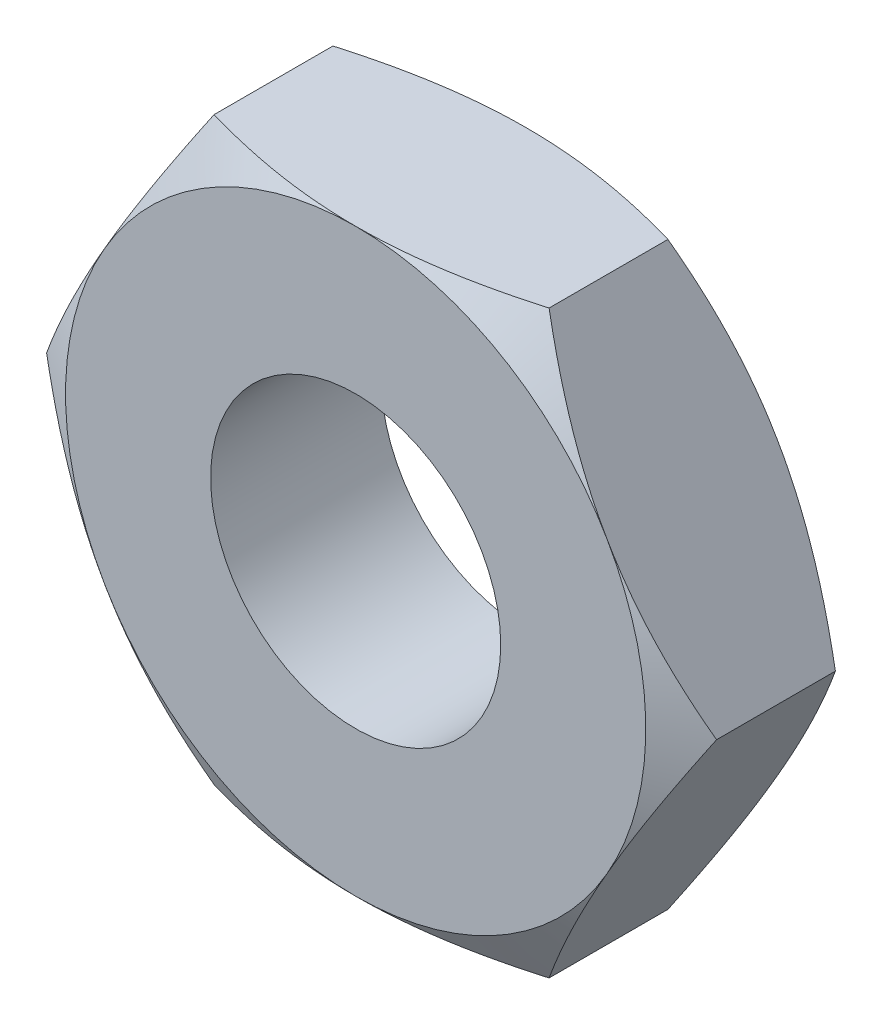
ISO-10303-21;
HEADER;
FILE_DESCRIPTION(('STEP AP214'),'2;1');
FILE_NAME('part.step','',(''),(''),'','','');
FILE_SCHEMA(('AUTOMOTIVE_DESIGN { 1 0 10303 214 1 1 1 1 }'));
ENDSEC;
DATA;
#1=APPLICATION_CONTEXT('core data for automotive mechanical design processes');
#2=APPLICATION_PROTOCOL_DEFINITION('international standard','automotive_design',2000,#1);
#3=PRODUCT_CONTEXT('',#1,'mechanical');
#4=PRODUCT('Part','Part','',(#3));
#5=PRODUCT_RELATED_PRODUCT_CATEGORY('part','',(#4));
#6=PRODUCT_DEFINITION_FORMATION('','',#4);
#7=PRODUCT_DEFINITION_CONTEXT('part definition',#1,'design');
#8=PRODUCT_DEFINITION('design','',#6,#7);
#9=PRODUCT_DEFINITION_SHAPE('','',#8);
#10=(LENGTH_UNIT() NAMED_UNIT(*) SI_UNIT(.MILLI.,.METRE.));
#11=(NAMED_UNIT(*) PLANE_ANGLE_UNIT() SI_UNIT($,.RADIAN.));
#12=(NAMED_UNIT(*) SI_UNIT($,.STERADIAN.) SOLID_ANGLE_UNIT());
#13=UNCERTAINTY_MEASURE_WITH_UNIT(LENGTH_MEASURE(1.E-05),#10,'distance_accuracy_value','');
#14=(GEOMETRIC_REPRESENTATION_CONTEXT(3) GLOBAL_UNCERTAINTY_ASSIGNED_CONTEXT((#13)) GLOBAL_UNIT_ASSIGNED_CONTEXT((#10,
#11,#12)) REPRESENTATION_CONTEXT('',''));
#15=CARTESIAN_POINT('',(0.,0.,0.));
#16=DIRECTION('',(0.,0.,1.));
#17=DIRECTION('',(1.,0.,0.));
#18=AXIS2_PLACEMENT_3D('',#15,#16,#17);
#19=CARTESIAN_POINT('',(-4.90747728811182,-8.5,5.));
#20=DIRECTION('',(0.,1.,0.));
#21=DIRECTION('',(0.,0.,1.));
#22=AXIS2_PLACEMENT_3D('',#19,#20,#21);
#23=PLANE('',#22);
#24=DIRECTION('',(0.,0.,-1.));
#25=VECTOR('',#24,1.);
#26=CARTESIAN_POINT('',(-4.90747728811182,-8.5,5.));
#27=LINE('',#26,#25);
#28=CARTESIAN_POINT('',(-4.90747728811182,-8.5,4.24081062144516));
#29=VERTEX_POINT('',#28);
#30=CARTESIAN_POINT('',(-4.90747728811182,-8.5,0.759189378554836));
#31=VERTEX_POINT('',#30);
#32=EDGE_CURVE('E257',#29,#31,#27,.T.);
#33=ORIENTED_EDGE('',*,*,#32,.T.);
#34=CARTESIAN_POINT('',(-13.0153529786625,-8.5,4.06747699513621));
#35=CARTESIAN_POINT('',(-12.6421549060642,-8.5,3.88712707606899));
#36=CARTESIAN_POINT('',(-12.2680744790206,-8.5,3.70856998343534));
#37=CARTESIAN_POINT('',(-11.5176718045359,-8.5,3.35606593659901));
#38=CARTESIAN_POINT('',(-11.1413491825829,-8.5,3.18211978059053));
#39=CARTESIAN_POINT('',(-10.3839521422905,-8.5,2.83894573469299));
#40=CARTESIAN_POINT('',(-10.0028628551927,-8.5,2.66975054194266));
#41=CARTESIAN_POINT('',(-9.23755213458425,-8.5,2.33862749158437));
#42=CARTESIAN_POINT('',(-8.85333086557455,-8.5,2.17669925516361));
#43=CARTESIAN_POINT('',(-8.07637493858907,-8.5,1.86012014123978));
#44=CARTESIAN_POINT('',(-7.68359367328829,-8.5,1.70558301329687));
#45=CARTESIAN_POINT('',(-6.89339929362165,-8.5,1.40861195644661));
#46=CARTESIAN_POINT('',(-6.4959856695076,-8.5,1.26617937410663));
#47=CARTESIAN_POINT('',(-5.69670564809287,-8.5,0.997245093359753));
#48=CARTESIAN_POINT('',(-5.29485077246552,-8.5,0.870709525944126));
#49=CARTESIAN_POINT('',(-4.48544256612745,-8.5,0.637676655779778));
#50=CARTESIAN_POINT('',(-4.07789108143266,-8.5,0.531173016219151));
#51=CARTESIAN_POINT('',(-3.25674318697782,-8.5,0.343382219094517));
#52=CARTESIAN_POINT('',(-2.84314519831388,-8.5,0.262101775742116));
#53=CARTESIAN_POINT('',(-2.21910871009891,-8.5,0.163168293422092));
#54=CARTESIAN_POINT('',(-2.01046436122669,-8.5,0.134019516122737));
#55=CARTESIAN_POINT('',(-1.59219744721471,-8.5,0.0839578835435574));
#56=CARTESIAN_POINT('',(-1.38257498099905,-8.5,0.0630442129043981));
#57=CARTESIAN_POINT('',(-0.963964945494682,-8.5,0.0300156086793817));
#58=CARTESIAN_POINT('',(-0.754981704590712,-8.5,0.0178460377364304));
#59=CARTESIAN_POINT('',(-0.336687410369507,-8.5,0.00236997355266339));
#60=CARTESIAN_POINT('',(-0.12737636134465,-8.5,-0.000936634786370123));
#61=CARTESIAN_POINT('',(0.291137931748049,-8.5,0.00139201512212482));
#62=CARTESIAN_POINT('',(0.500341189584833,-8.5,0.00702476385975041));
#63=CARTESIAN_POINT('',(0.918327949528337,-8.5,0.0270920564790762));
#64=CARTESIAN_POINT('',(1.12711143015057,-8.5,0.0415270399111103));
#65=CARTESIAN_POINT('',(1.63313830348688,-8.5,0.0868790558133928));
#66=CARTESIAN_POINT('',(1.92999290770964,-8.5,0.122206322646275));
#67=CARTESIAN_POINT('',(2.52142734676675,-8.5,0.208694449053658));
#68=CARTESIAN_POINT('',(2.81600653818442,-8.5,0.259859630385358));
#69=CARTESIAN_POINT('',(3.40264712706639,-8.5,0.3762089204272));
#70=CARTESIAN_POINT('',(3.69470587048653,-8.5,0.441406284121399));
#71=CARTESIAN_POINT('',(4.27581848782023,-8.5,0.583830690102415));
#72=CARTESIAN_POINT('',(4.56487264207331,-8.5,0.661056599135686));
#73=CARTESIAN_POINT('',(5.14709542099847,-8.5,0.827709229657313));
#74=CARTESIAN_POINT('',(5.44019122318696,-8.5,0.917388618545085));
#75=CARTESIAN_POINT('',(6.02328479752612,-8.5,1.10560823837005));
#76=CARTESIAN_POINT('',(6.31328455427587,-8.5,1.20414235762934));
#77=CARTESIAN_POINT('',(6.88902237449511,-8.5,1.40803611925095));
#78=CARTESIAN_POINT('',(7.17477523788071,-8.5,1.51335422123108));
#79=CARTESIAN_POINT('',(7.74406391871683,-8.5,1.73017199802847));
#80=CARTESIAN_POINT('',(8.02759878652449,-8.5,1.84167417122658));
#81=CARTESIAN_POINT('',(8.31010360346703,-8.5,1.95565663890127));
#82=B_SPLINE_CURVE_WITH_KNOTS('',3,(#34,#35,#36,#37,#38,#39,#40,#41,#42,#43,#44,#45,#46,#47,#48,
#49,#50,#51,#52,#53,#54,#55,#56,#57,#58,#59,#60,#61,#62,#63,#64,#65,#66,#67,#68,#69,#70,#71,#72,
#73,#74,#75,#76,#77,#78,#79,#80,#81),.UNSPECIFIED.,.F.,.F.,(4,2,2,2,2,2,2,2,2,2,2,2,2,2,2,2,2,2,
2,2,2,2,2,4),(0.,1.24349005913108,2.4871939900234,3.7380151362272,4.98877100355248,
6.25488227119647,7.52113420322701,8.78464087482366,10.0477471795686,11.3111894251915,
11.9430642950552,12.5748765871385,13.2027058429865,13.8305269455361,14.4581718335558,
15.0858480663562,15.9821964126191,16.8787895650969,17.7762333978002,18.6735927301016,
19.5929482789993,20.5116740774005,21.4252286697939,22.3391550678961),.UNSPECIFIED.);
#83=CARTESIAN_POINT('',(0.,-8.5,0.));
#84=VERTEX_POINT('',#83);
#85=EDGE_CURVE('E60',#31,#84,#82,.T.);
#86=ORIENTED_EDGE('',*,*,#85,.T.);
#87=CARTESIAN_POINT('',(4.90747728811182,-8.5,0.759189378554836));
#88=VERTEX_POINT('',#87);
#89=EDGE_CURVE('E214',#84,#88,#82,.T.);
#90=ORIENTED_EDGE('',*,*,#89,.T.);
#91=DIRECTION('',(0.,0.,-1.));
#92=VECTOR('',#91,1.);
#93=CARTESIAN_POINT('',(4.90747728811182,-8.5,5.));
#94=LINE('',#93,#92);
#95=CARTESIAN_POINT('',(4.90747728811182,-8.5,4.24081062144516));
#96=VERTEX_POINT('',#95);
#97=EDGE_CURVE('E274',#96,#88,#94,.T.);
#98=ORIENTED_EDGE('',*,*,#97,.F.);
#99=CARTESIAN_POINT('',(-13.0153529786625,-8.5,0.932523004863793));
#100=CARTESIAN_POINT('',(-12.6421549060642,-8.5,1.11287292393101));
#101=CARTESIAN_POINT('',(-12.2680744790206,-8.5,1.29143001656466));
#102=CARTESIAN_POINT('',(-11.5176718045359,-8.5,1.64393406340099));
#103=CARTESIAN_POINT('',(-11.1413491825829,-8.5,1.81788021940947));
#104=CARTESIAN_POINT('',(-10.3839521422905,-8.5,2.16105426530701));
#105=CARTESIAN_POINT('',(-10.0028628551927,-8.5,2.33024945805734));
#106=CARTESIAN_POINT('',(-9.23755213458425,-8.5,2.66137250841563));
#107=CARTESIAN_POINT('',(-8.85333086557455,-8.5,2.82330074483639));
#108=CARTESIAN_POINT('',(-8.07637493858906,-8.5,3.13987985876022));
#109=CARTESIAN_POINT('',(-7.68359367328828,-8.5,3.29441698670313));
#110=CARTESIAN_POINT('',(-6.89339929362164,-8.5,3.59138804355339));
#111=CARTESIAN_POINT('',(-6.49598566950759,-8.5,3.73382062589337));
#112=CARTESIAN_POINT('',(-5.69670564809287,-8.5,4.00275490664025));
#113=CARTESIAN_POINT('',(-5.29485077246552,-8.5,4.12929047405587));
#114=CARTESIAN_POINT('',(-4.48544256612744,-8.5,4.36232334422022));
#115=CARTESIAN_POINT('',(-4.07789108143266,-8.5,4.46882698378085));
#116=CARTESIAN_POINT('',(-3.25674318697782,-8.5,4.65661778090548));
#117=CARTESIAN_POINT('',(-2.84314519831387,-8.5,4.73789822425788));
#118=CARTESIAN_POINT('',(-2.2191087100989,-8.5,4.83683170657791));
#119=CARTESIAN_POINT('',(-2.01046436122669,-8.5,4.86598048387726));
#120=CARTESIAN_POINT('',(-1.59219744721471,-8.5,4.91604211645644));
#121=CARTESIAN_POINT('',(-1.38257498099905,-8.5,4.9369557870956));
#122=CARTESIAN_POINT('',(-0.963964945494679,-8.5,4.96998439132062));
#123=CARTESIAN_POINT('',(-0.75498170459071,-8.5,4.98215396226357));
#124=CARTESIAN_POINT('',(-0.336687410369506,-8.5,4.99763002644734));
#125=CARTESIAN_POINT('',(-0.127376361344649,-8.5,5.00093663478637));
#126=CARTESIAN_POINT('',(0.29113793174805,-8.5,4.99860798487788));
#127=CARTESIAN_POINT('',(0.500341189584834,-8.5,4.99297523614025));
#128=CARTESIAN_POINT('',(0.918327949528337,-8.5,4.97290794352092));
#129=CARTESIAN_POINT('',(1.12711143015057,-8.5,4.95847296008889));
#130=CARTESIAN_POINT('',(1.63313830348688,-8.5,4.91312094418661));
#131=CARTESIAN_POINT('',(1.92999290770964,-8.5,4.87779367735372));
#132=CARTESIAN_POINT('',(2.52142734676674,-8.5,4.79130555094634));
#133=CARTESIAN_POINT('',(2.81600653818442,-8.5,4.74014036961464));
#134=CARTESIAN_POINT('',(3.40264712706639,-8.5,4.6237910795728));
#135=CARTESIAN_POINT('',(3.69470587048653,-8.5,4.5585937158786));
#136=CARTESIAN_POINT('',(4.27581848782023,-8.5,4.41616930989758));
#137=CARTESIAN_POINT('',(4.56487264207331,-8.5,4.33894340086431));
#138=CARTESIAN_POINT('',(5.14709542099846,-8.5,4.17229077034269));
#139=CARTESIAN_POINT('',(5.44019122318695,-8.5,4.08261138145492));
#140=CARTESIAN_POINT('',(6.02328479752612,-8.5,3.89439176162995));
#141=CARTESIAN_POINT('',(6.31328455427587,-8.5,3.79585764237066));
#142=CARTESIAN_POINT('',(6.88902237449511,-8.5,3.59196388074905));
#143=CARTESIAN_POINT('',(7.17477523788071,-8.5,3.48664577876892));
#144=CARTESIAN_POINT('',(7.74406391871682,-8.5,3.26982800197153));
#145=CARTESIAN_POINT('',(8.02759878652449,-8.5,3.15832582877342));
#146=CARTESIAN_POINT('',(8.31010360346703,-8.5,3.04434336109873));
#147=B_SPLINE_CURVE_WITH_KNOTS('',3,(#99,#100,#101,#102,#103,#104,#105,#106,#107,#108,#109,#110,
#111,#112,#113,#114,#115,#116,#117,#118,#119,#120,#121,#122,#123,#124,#125,#126,#127,#128,#129,
#130,#131,#132,#133,#134,#135,#136,#137,#138,#139,#140,#141,#142,#143,#144,#145,#146),
.UNSPECIFIED.,.F.,.F.,(4,2,2,2,2,2,2,2,2,2,2,2,2,2,2,2,2,2,2,2,2,2,2,4),(0.,1.24349005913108,
2.4871939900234,3.7380151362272,4.98877100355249,6.25488227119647,7.52113420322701,
8.78464087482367,10.0477471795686,11.3111894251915,11.9430642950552,12.5748765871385,
13.2027058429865,13.8305269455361,14.4581718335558,15.0858480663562,15.9821964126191,
16.8787895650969,17.7762333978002,18.6735927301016,19.5929482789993,20.5116740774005,
21.4252286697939,22.3391550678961),.UNSPECIFIED.);
#148=CARTESIAN_POINT('',(0.,-8.5,5.));
#149=VERTEX_POINT('',#148);
#150=EDGE_CURVE('E326',#96,#149,#147,.F.);
#151=ORIENTED_EDGE('',*,*,#150,.T.);
#152=EDGE_CURVE('E320',#149,#29,#147,.F.);
#153=ORIENTED_EDGE('',*,*,#152,.T.);
#154=EDGE_LOOP('',(#33,#86,#90,#98,#151,#153));
#155=FACE_BOUND('',#154,.T.);
#156=ADVANCED_FACE('F37',(#155),#23,.F.);
#157=CARTESIAN_POINT('',(4.90747728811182,-8.5,5.));
#158=DIRECTION('',(-0.866025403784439,0.5,0.));
#159=DIRECTION('',(-0.5,-0.866025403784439,0.));
#160=AXIS2_PLACEMENT_3D('',#157,#158,#159);
#161=PLANE('',#160);
#162=ORIENTED_EDGE('',*,*,#97,.T.);
#163=CARTESIAN_POINT('',(4.90736181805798,-8.5002,0.75925604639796));
#164=CARTESIAN_POINT('',(5.01523349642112,-8.31336077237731,0.696986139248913));
#165=CARTESIAN_POINT('',(5.1235073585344,-8.1258249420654,0.637542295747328));
#166=CARTESIAN_POINT('',(5.34093440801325,-7.74923024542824,0.525085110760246));
#167=CARTESIAN_POINT('',(5.45008795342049,-7.56017075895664,0.472074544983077));
#168=CARTESIAN_POINT('',(5.77929626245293,-6.98996524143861,0.32373338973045));
#169=CARTESIAN_POINT('',(6.00065055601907,-6.60656835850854,0.23935892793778));
#170=CARTESIAN_POINT('',(6.33190297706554,-6.03282233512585,0.14042001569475));
#171=CARTESIAN_POINT('',(6.44081150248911,-5.84418723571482,0.112235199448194));
#172=CARTESIAN_POINT('',(6.65912106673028,-5.4660639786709,0.064974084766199));
#173=CARTESIAN_POINT('',(6.76852206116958,-5.27657589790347,0.0458969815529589));
#174=CARTESIAN_POINT('',(6.98751241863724,-4.89727347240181,0.0173347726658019));
#175=CARTESIAN_POINT('',(7.09710142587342,-4.70745974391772,0.00783878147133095));
#176=CARTESIAN_POINT('',(7.31638067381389,-4.32765694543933,-0.00135762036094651));
#177=CARTESIAN_POINT('',(7.42607091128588,-4.13766788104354,-0.00105833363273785));
#178=CARTESIAN_POINT('',(7.63114046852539,-3.78247698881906,0.00865447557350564));
#179=CARTESIAN_POINT('',(7.72653426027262,-3.61725009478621,0.0168831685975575));
#180=CARTESIAN_POINT('',(7.9170984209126,-3.28718328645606,0.0405892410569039));
#181=CARTESIAN_POINT('',(8.01226877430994,-3.12234339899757,0.0560671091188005));
#182=CARTESIAN_POINT('',(8.29741139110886,-2.6284618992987,0.113008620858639));
#183=CARTESIAN_POINT('',(8.48687892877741,-2.3002944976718,0.164973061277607));
#184=CARTESIAN_POINT('',(8.86782383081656,-1.64047857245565,0.29488494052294));
#185=CARTESIAN_POINT('',(9.05925257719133,-1.30891425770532,0.373383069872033));
#186=CARTESIAN_POINT('',(9.43925537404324,-0.650730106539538,0.551541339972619));
#187=CARTESIAN_POINT('',(9.62783429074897,-0.324101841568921,0.651159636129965));
#188=CARTESIAN_POINT('',(9.81507004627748,0.000199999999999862,0.75925604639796));
#189=B_SPLINE_CURVE_WITH_KNOTS('',3,(#163,#164,#165,#166,#167,#168,#169,#170,#171,#172,#173,
#174,#175,#176,#177,#178,#179,#180,#181,#182,#183,#184,#185,#186,#187,#188),.UNSPECIFIED.,.F.,
.F.,(4,2,2,2,2,2,2,2,2,2,2,2,4),(0.,0.673596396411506,1.34748239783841,2.69805431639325,
3.35679995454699,4.01548737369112,4.67342558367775,5.33134346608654,5.90409556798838,
6.47688628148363,7.62328361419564,8.79510569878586,9.9646274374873),.UNSPECIFIED.);
#190=CARTESIAN_POINT('',(7.36121593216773,-4.25,0.));
#191=VERTEX_POINT('',#190);
#192=EDGE_CURVE('E212',#88,#191,#189,.T.);
#193=ORIENTED_EDGE('',*,*,#192,.T.);
#194=CARTESIAN_POINT('',(9.81495457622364,0.,0.759189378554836));
#195=VERTEX_POINT('',#194);
#196=EDGE_CURVE('E206',#191,#195,#189,.T.);
#197=ORIENTED_EDGE('',*,*,#196,.T.);
#198=DIRECTION('',(0.,0.,-1.));
#199=VECTOR('',#198,1.);
#200=CARTESIAN_POINT('',(9.81495457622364,0.,5.));
#201=LINE('',#200,#199);
#202=CARTESIAN_POINT('',(9.81495457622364,0.,4.24081062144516));
#203=VERTEX_POINT('',#202);
#204=EDGE_CURVE('E270',#203,#195,#201,.T.);
#205=ORIENTED_EDGE('',*,*,#204,.F.);
#206=CARTESIAN_POINT('',(9.81507004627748,0.000199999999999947,4.24074395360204));
#207=CARTESIAN_POINT('',(9.70719836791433,-0.18663922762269,4.30301386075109));
#208=CARTESIAN_POINT('',(9.59892450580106,-0.374175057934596,4.36245770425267));
#209=CARTESIAN_POINT('',(9.3814974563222,-0.750769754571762,4.47491488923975));
#210=CARTESIAN_POINT('',(9.27234391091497,-0.939829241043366,4.52792545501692));
#211=CARTESIAN_POINT('',(8.94313560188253,-1.5100347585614,4.67626661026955));
#212=CARTESIAN_POINT('',(8.72178130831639,-1.89343164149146,4.76064107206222));
#213=CARTESIAN_POINT('',(8.39052888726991,-2.46717766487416,4.85957998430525));
#214=CARTESIAN_POINT('',(8.28162036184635,-2.65581276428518,4.88776480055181));
#215=CARTESIAN_POINT('',(8.06331079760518,-3.03393602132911,4.9350259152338));
#216=CARTESIAN_POINT('',(7.95390980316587,-3.22342410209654,4.95410301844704));
#217=CARTESIAN_POINT('',(7.73491944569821,-3.6027265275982,4.9826652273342));
#218=CARTESIAN_POINT('',(7.62533043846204,-3.79254025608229,4.99216121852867));
#219=CARTESIAN_POINT('',(7.40605119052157,-4.17234305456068,5.00135762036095));
#220=CARTESIAN_POINT('',(7.29636095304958,-4.36233211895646,5.00105833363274));
#221=CARTESIAN_POINT('',(7.09129139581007,-4.71752301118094,4.99134552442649));
#222=CARTESIAN_POINT('',(6.99589760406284,-4.88274990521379,4.98311683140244));
#223=CARTESIAN_POINT('',(6.80533344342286,-5.21281671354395,4.95941075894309));
#224=CARTESIAN_POINT('',(6.71016309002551,-5.37765660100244,4.9439328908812));
#225=CARTESIAN_POINT('',(6.42502047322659,-5.87153810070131,4.88699137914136));
#226=CARTESIAN_POINT('',(6.23555293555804,-6.19970550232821,4.83502693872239));
#227=CARTESIAN_POINT('',(5.8546080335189,-6.85952142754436,4.70511505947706));
#228=CARTESIAN_POINT('',(5.66317928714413,-7.19108574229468,4.62661693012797));
#229=CARTESIAN_POINT('',(5.28317649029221,-7.84926989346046,4.44845866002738));
#230=CARTESIAN_POINT('',(5.09459757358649,-8.17589815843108,4.34884036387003));
#231=CARTESIAN_POINT('',(4.90736181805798,-8.5002,4.24074395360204));
#232=B_SPLINE_CURVE_WITH_KNOTS('',3,(#206,#207,#208,#209,#210,#211,#212,#213,#214,#215,#216,
#217,#218,#219,#220,#221,#222,#223,#224,#225,#226,#227,#228,#229,#230,#231),.UNSPECIFIED.,.F.,
.F.,(4,2,2,2,2,2,2,2,2,2,2,2,4),(0.,0.673596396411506,1.34748239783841,2.69805431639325,
3.35679995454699,4.01548737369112,4.67342558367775,5.33134346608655,5.90409556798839,
6.47688628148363,7.62328361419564,8.79510569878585,9.9646274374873),.UNSPECIFIED.);
#233=CARTESIAN_POINT('',(7.36121593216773,-4.25,5.));
#234=VERTEX_POINT('',#233);
#235=EDGE_CURVE('E235',#203,#234,#232,.T.);
#236=ORIENTED_EDGE('',*,*,#235,.T.);
#237=EDGE_CURVE('E227',#234,#96,#232,.T.);
#238=ORIENTED_EDGE('',*,*,#237,.T.);
#239=EDGE_LOOP('',(#162,#193,#197,#205,#236,#238));
#240=FACE_BOUND('',#239,.T.);
#241=ADVANCED_FACE('F219',(#240),#161,.F.);
#242=CARTESIAN_POINT('',(9.81495457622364,0.,5.));
#243=DIRECTION('',(-0.866025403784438,-0.5,0.));
#244=DIRECTION('',(0.5,-0.866025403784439,0.));
#245=AXIS2_PLACEMENT_3D('',#242,#243,#244);
#246=PLANE('',#245);
#247=ORIENTED_EDGE('',*,*,#204,.T.);
#248=CARTESIAN_POINT('',(9.81507004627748,-0.0002000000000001,0.75925604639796));
#249=CARTESIAN_POINT('',(9.70719836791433,0.18663922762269,0.696986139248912));
#250=CARTESIAN_POINT('',(9.59892450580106,0.374175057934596,0.637542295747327));
#251=CARTESIAN_POINT('',(9.3814974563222,0.750769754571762,0.525085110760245));
#252=CARTESIAN_POINT('',(9.27234391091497,0.939829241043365,0.472074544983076));
#253=CARTESIAN_POINT('',(8.94313560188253,1.5100347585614,0.32373338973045));
#254=CARTESIAN_POINT('',(8.72178130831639,1.89343164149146,0.23935892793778));
#255=CARTESIAN_POINT('',(8.39052888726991,2.46717766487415,0.14042001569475));
#256=CARTESIAN_POINT('',(8.28162036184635,2.65581276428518,0.112235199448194));
#257=CARTESIAN_POINT('',(8.06331079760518,3.0339360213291,0.0649740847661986));
#258=CARTESIAN_POINT('',(7.95390980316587,3.22342410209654,0.0458969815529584));
#259=CARTESIAN_POINT('',(7.73491944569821,3.60272652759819,0.0173347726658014));
#260=CARTESIAN_POINT('',(7.62533043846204,3.79254025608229,0.00783878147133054));
#261=CARTESIAN_POINT('',(7.40605119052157,4.17234305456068,-0.00135762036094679));
#262=CARTESIAN_POINT('',(7.29636095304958,4.36233211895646,-0.00105833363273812));
#263=CARTESIAN_POINT('',(7.09129139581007,4.71752301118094,0.0086544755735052));
#264=CARTESIAN_POINT('',(6.99589760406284,4.88274990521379,0.0168831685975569));
#265=CARTESIAN_POINT('',(6.80533344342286,5.21281671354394,0.0405892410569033));
#266=CARTESIAN_POINT('',(6.71016309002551,5.37765660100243,0.0560671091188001));
#267=CARTESIAN_POINT('',(6.42502047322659,5.87153810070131,0.113008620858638));
#268=CARTESIAN_POINT('',(6.23555293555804,6.19970550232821,0.164973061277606));
#269=CARTESIAN_POINT('',(5.8546080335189,6.85952142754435,0.294884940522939));
#270=CARTESIAN_POINT('',(5.66317928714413,7.19108574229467,0.373383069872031));
#271=CARTESIAN_POINT('',(5.28317649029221,7.84926989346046,0.551541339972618));
#272=CARTESIAN_POINT('',(5.09459757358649,8.17589815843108,0.651159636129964));
#273=CARTESIAN_POINT('',(4.90736181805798,8.5002,0.759256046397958));
#274=B_SPLINE_CURVE_WITH_KNOTS('',3,(#248,#249,#250,#251,#252,#253,#254,#255,#256,#257,#258,
#259,#260,#261,#262,#263,#264,#265,#266,#267,#268,#269,#270,#271,#272,#273),.UNSPECIFIED.,.F.,
.F.,(4,2,2,2,2,2,2,2,2,2,2,2,4),(0.,0.673596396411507,1.34748239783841,2.69805431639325,
3.35679995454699,4.01548737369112,4.67342558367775,5.33134346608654,5.90409556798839,
6.47688628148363,7.62328361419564,8.79510569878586,9.9646274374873),.UNSPECIFIED.);
#275=CARTESIAN_POINT('',(7.36121593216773,4.25,0.));
#276=VERTEX_POINT('',#275);
#277=EDGE_CURVE('E213',#195,#276,#274,.T.);
#278=ORIENTED_EDGE('',*,*,#277,.T.);
#279=CARTESIAN_POINT('',(4.90747728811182,8.5,0.759189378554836));
#280=VERTEX_POINT('',#279);
#281=EDGE_CURVE('E200',#276,#280,#274,.T.);
#282=ORIENTED_EDGE('',*,*,#281,.T.);
#283=DIRECTION('',(0.,0.,-1.));
#284=VECTOR('',#283,1.);
#285=CARTESIAN_POINT('',(4.90747728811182,8.5,5.));
#286=LINE('',#285,#284);
#287=CARTESIAN_POINT('',(4.90747728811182,8.5,4.24081062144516));
#288=VERTEX_POINT('',#287);
#289=EDGE_CURVE('E266',#288,#280,#286,.T.);
#290=ORIENTED_EDGE('',*,*,#289,.F.);
#291=CARTESIAN_POINT('',(4.90736181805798,8.5002,4.24074395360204));
#292=CARTESIAN_POINT('',(5.01523349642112,8.31336077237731,4.30301386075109));
#293=CARTESIAN_POINT('',(5.1235073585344,8.1258249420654,4.36245770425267));
#294=CARTESIAN_POINT('',(5.34093440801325,7.74923024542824,4.47491488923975));
#295=CARTESIAN_POINT('',(5.45008795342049,7.56017075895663,4.52792545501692));
#296=CARTESIAN_POINT('',(5.77929626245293,6.9899652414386,4.67626661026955));
#297=CARTESIAN_POINT('',(6.00065055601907,6.60656835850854,4.76064107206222));
#298=CARTESIAN_POINT('',(6.33190297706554,6.03282233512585,4.85957998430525));
#299=CARTESIAN_POINT('',(6.44081150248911,5.84418723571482,4.88776480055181));
#300=CARTESIAN_POINT('',(6.65912106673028,5.4660639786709,4.9350259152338));
#301=CARTESIAN_POINT('',(6.76852206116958,5.27657589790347,4.95410301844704));
#302=CARTESIAN_POINT('',(6.98751241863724,4.89727347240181,4.9826652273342));
#303=CARTESIAN_POINT('',(7.09710142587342,4.70745974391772,4.99216121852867));
#304=CARTESIAN_POINT('',(7.31638067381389,4.32765694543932,5.00135762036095));
#305=CARTESIAN_POINT('',(7.42607091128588,4.13766788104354,5.00105833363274));
#306=CARTESIAN_POINT('',(7.63114046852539,3.78247698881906,4.99134552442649));
#307=CARTESIAN_POINT('',(7.72653426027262,3.61725009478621,4.98311683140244));
#308=CARTESIAN_POINT('',(7.9170984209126,3.28718328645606,4.9594107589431));
#309=CARTESIAN_POINT('',(8.01226877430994,3.12234339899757,4.9439328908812));
#310=CARTESIAN_POINT('',(8.29741139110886,2.62846189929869,4.88699137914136));
#311=CARTESIAN_POINT('',(8.48687892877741,2.30029449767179,4.83502693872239));
#312=CARTESIAN_POINT('',(8.86782383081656,1.64047857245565,4.70511505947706));
#313=CARTESIAN_POINT('',(9.05925257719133,1.30891425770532,4.62661693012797));
#314=CARTESIAN_POINT('',(9.43925537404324,0.650730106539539,4.44845866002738));
#315=CARTESIAN_POINT('',(9.62783429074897,0.324101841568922,4.34884036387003));
#316=CARTESIAN_POINT('',(9.81507004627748,-0.000199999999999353,4.24074395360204));
#317=B_SPLINE_CURVE_WITH_KNOTS('',3,(#291,#292,#293,#294,#295,#296,#297,#298,#299,#300,#301,
#302,#303,#304,#305,#306,#307,#308,#309,#310,#311,#312,#313,#314,#315,#316),.UNSPECIFIED.,.F.,
.F.,(4,2,2,2,2,2,2,2,2,2,2,2,4),(0.,0.673596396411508,1.34748239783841,2.69805431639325,
3.35679995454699,4.01548737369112,4.67342558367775,5.33134346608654,5.90409556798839,
6.47688628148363,7.62328361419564,8.79510569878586,9.9646274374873),.UNSPECIFIED.);
#318=CARTESIAN_POINT('',(7.36121593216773,4.25,5.));
#319=VERTEX_POINT('',#318);
#320=EDGE_CURVE('E248',#288,#319,#317,.T.);
#321=ORIENTED_EDGE('',*,*,#320,.T.);
#322=EDGE_CURVE('E241',#319,#203,#317,.T.);
#323=ORIENTED_EDGE('',*,*,#322,.T.);
#324=EDGE_LOOP('',(#247,#278,#282,#290,#321,#323));
#325=FACE_BOUND('',#324,.T.);
#326=ADVANCED_FACE('F222',(#325),#246,.F.);
#327=CARTESIAN_POINT('',(4.90747728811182,8.5,5.));
#328=DIRECTION('',(0.,-1.,0.));
#329=DIRECTION('',(1.,0.,0.));
#330=AXIS2_PLACEMENT_3D('',#327,#328,#329);
#331=PLANE('',#330);
#332=ORIENTED_EDGE('',*,*,#289,.T.);
#333=CARTESIAN_POINT('',(-13.0153529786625,8.5,4.06747699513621));
#334=CARTESIAN_POINT('',(-12.6421549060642,8.5,3.88712707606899));
#335=CARTESIAN_POINT('',(-12.2680744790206,8.5,3.70856998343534));
#336=CARTESIAN_POINT('',(-11.5176718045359,8.5,3.35606593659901));
#337=CARTESIAN_POINT('',(-11.1413491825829,8.5,3.18211978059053));
#338=CARTESIAN_POINT('',(-10.3839521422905,8.5,2.83894573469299));
#339=CARTESIAN_POINT('',(-10.0028628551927,8.5,2.66975054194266));
#340=CARTESIAN_POINT('',(-9.23755213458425,8.5,2.33862749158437));
#341=CARTESIAN_POINT('',(-8.85333086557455,8.5,2.17669925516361));
#342=CARTESIAN_POINT('',(-8.07637493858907,8.5,1.86012014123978));
#343=CARTESIAN_POINT('',(-7.68359367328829,8.5,1.70558301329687));
#344=CARTESIAN_POINT('',(-6.89339929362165,8.5,1.40861195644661));
#345=CARTESIAN_POINT('',(-6.4959856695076,8.5,1.26617937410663));
#346=CARTESIAN_POINT('',(-5.69670564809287,8.5,0.997245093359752));
#347=CARTESIAN_POINT('',(-5.29485077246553,8.5,0.870709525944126));
#348=CARTESIAN_POINT('',(-4.48544256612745,8.5,0.637676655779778));
#349=CARTESIAN_POINT('',(-4.07789108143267,8.5,0.531173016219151));
#350=CARTESIAN_POINT('',(-3.25674318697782,8.5,0.343382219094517));
#351=CARTESIAN_POINT('',(-2.84314519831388,8.5,0.262101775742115));
#352=CARTESIAN_POINT('',(-2.21910871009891,8.5,0.163168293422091));
#353=CARTESIAN_POINT('',(-2.01046436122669,8.5,0.134019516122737));
#354=CARTESIAN_POINT('',(-1.59219744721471,8.5,0.0839578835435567));
#355=CARTESIAN_POINT('',(-1.38257498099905,8.5,0.0630442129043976));
#356=CARTESIAN_POINT('',(-0.963964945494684,8.5,0.0300156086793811));
#357=CARTESIAN_POINT('',(-0.754981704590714,8.5,0.0178460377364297));
#358=CARTESIAN_POINT('',(-0.336687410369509,8.5,0.00236997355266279));
#359=CARTESIAN_POINT('',(-0.127376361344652,8.5,-0.000936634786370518));
#360=CARTESIAN_POINT('',(0.291137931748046,8.5,0.00139201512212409));
#361=CARTESIAN_POINT('',(0.500341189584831,8.5,0.00702476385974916));
#362=CARTESIAN_POINT('',(0.918327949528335,8.5,0.0270920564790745));
#363=CARTESIAN_POINT('',(1.12711143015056,8.5,0.0415270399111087));
#364=CARTESIAN_POINT('',(1.63313830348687,8.5,0.086879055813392));
#365=CARTESIAN_POINT('',(1.92999290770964,8.5,0.122206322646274));
#366=CARTESIAN_POINT('',(2.52142734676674,8.5,0.208694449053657));
#367=CARTESIAN_POINT('',(2.81600653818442,8.5,0.259859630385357));
#368=CARTESIAN_POINT('',(3.40264712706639,8.5,0.376208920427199));
#369=CARTESIAN_POINT('',(3.69470587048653,8.5,0.441406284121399));
#370=CARTESIAN_POINT('',(4.27581848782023,8.5,0.583830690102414));
#371=CARTESIAN_POINT('',(4.56487264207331,8.5,0.661056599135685));
#372=CARTESIAN_POINT('',(5.14709542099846,8.5,0.827709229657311));
#373=CARTESIAN_POINT('',(5.44019122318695,8.5,0.917388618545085));
#374=CARTESIAN_POINT('',(6.02328479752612,8.5,1.10560823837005));
#375=CARTESIAN_POINT('',(6.31328455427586,8.5,1.20414235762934));
#376=CARTESIAN_POINT('',(6.88902237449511,8.5,1.40803611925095));
#377=CARTESIAN_POINT('',(7.17477523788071,8.5,1.51335422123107));
#378=CARTESIAN_POINT('',(7.74406391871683,8.5,1.73017199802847));
#379=CARTESIAN_POINT('',(8.02759878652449,8.5,1.84167417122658));
#380=CARTESIAN_POINT('',(8.31010360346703,8.5,1.95565663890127));
#381=B_SPLINE_CURVE_WITH_KNOTS('',3,(#333,#334,#335,#336,#337,#338,#339,#340,#341,#342,#343,
#344,#345,#346,#347,#348,#349,#350,#351,#352,#353,#354,#355,#356,#357,#358,#359,#360,#361,#362,
#363,#364,#365,#366,#367,#368,#369,#370,#371,#372,#373,#374,#375,#376,#377,#378,#379,#380),
.UNSPECIFIED.,.F.,.F.,(4,2,2,2,2,2,2,2,2,2,2,2,2,2,2,2,2,2,2,2,2,2,2,4),(0.,1.24349005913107,
2.4871939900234,3.7380151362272,4.98877100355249,6.25488227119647,7.52113420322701,
8.78464087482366,10.0477471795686,11.3111894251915,11.9430642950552,12.5748765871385,
13.2027058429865,13.8305269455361,14.4581718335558,15.0858480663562,15.9821964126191,
16.8787895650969,17.7762333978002,18.6735927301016,19.5929482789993,20.5116740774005,
21.4252286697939,22.3391550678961),.UNSPECIFIED.);
#382=CARTESIAN_POINT('',(0.,8.5,0.));
#383=VERTEX_POINT('',#382);
#384=EDGE_CURVE('E168',#280,#383,#381,.F.);
#385=ORIENTED_EDGE('',*,*,#384,.T.);
#386=CARTESIAN_POINT('',(-4.90747728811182,8.5,0.759189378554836));
#387=VERTEX_POINT('',#386);
#388=EDGE_CURVE('E147',#383,#387,#381,.F.);
#389=ORIENTED_EDGE('',*,*,#388,.T.);
#390=DIRECTION('',(0.,0.,-1.));
#391=VECTOR('',#390,1.);
#392=CARTESIAN_POINT('',(-4.90747728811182,8.5,5.));
#393=LINE('',#392,#391);
#394=CARTESIAN_POINT('',(-4.90747728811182,8.5,4.24081062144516));
#395=VERTEX_POINT('',#394);
#396=EDGE_CURVE('E163',#395,#387,#393,.T.);
#397=ORIENTED_EDGE('',*,*,#396,.F.);
#398=CARTESIAN_POINT('',(-13.0153529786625,8.5,0.932523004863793));
#399=CARTESIAN_POINT('',(-12.6421549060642,8.5,1.11287292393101));
#400=CARTESIAN_POINT('',(-12.2680744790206,8.5,1.29143001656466));
#401=CARTESIAN_POINT('',(-11.5176718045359,8.5,1.64393406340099));
#402=CARTESIAN_POINT('',(-11.1413491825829,8.5,1.81788021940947));
#403=CARTESIAN_POINT('',(-10.3839521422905,8.5,2.16105426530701));
#404=CARTESIAN_POINT('',(-10.0028628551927,8.5,2.33024945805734));
#405=CARTESIAN_POINT('',(-9.23755213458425,8.5,2.66137250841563));
#406=CARTESIAN_POINT('',(-8.85333086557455,8.5,2.82330074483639));
#407=CARTESIAN_POINT('',(-8.07637493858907,8.5,3.13987985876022));
#408=CARTESIAN_POINT('',(-7.68359367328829,8.5,3.29441698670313));
#409=CARTESIAN_POINT('',(-6.89339929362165,8.5,3.59138804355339));
#410=CARTESIAN_POINT('',(-6.4959856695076,8.5,3.73382062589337));
#411=CARTESIAN_POINT('',(-5.69670564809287,8.5,4.00275490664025));
#412=CARTESIAN_POINT('',(-5.29485077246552,8.5,4.12929047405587));
#413=CARTESIAN_POINT('',(-4.48544256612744,8.5,4.36232334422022));
#414=CARTESIAN_POINT('',(-4.07789108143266,8.5,4.46882698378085));
#415=CARTESIAN_POINT('',(-3.25674318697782,8.5,4.65661778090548));
#416=CARTESIAN_POINT('',(-2.84314519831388,8.5,4.73789822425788));
#417=CARTESIAN_POINT('',(-2.21910871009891,8.5,4.83683170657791));
#418=CARTESIAN_POINT('',(-2.01046436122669,8.5,4.86598048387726));
#419=CARTESIAN_POINT('',(-1.59219744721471,8.5,4.91604211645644));
#420=CARTESIAN_POINT('',(-1.38257498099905,8.5,4.9369557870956));
#421=CARTESIAN_POINT('',(-0.96396494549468,8.5,4.96998439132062));
#422=CARTESIAN_POINT('',(-0.754981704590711,8.5,4.98215396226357));
#423=CARTESIAN_POINT('',(-0.336687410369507,8.5,4.99763002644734));
#424=CARTESIAN_POINT('',(-0.127376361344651,8.5,5.00093663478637));
#425=CARTESIAN_POINT('',(0.291137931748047,8.5,4.99860798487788));
#426=CARTESIAN_POINT('',(0.500341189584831,8.5,4.99297523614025));
#427=CARTESIAN_POINT('',(0.918327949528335,8.5,4.97290794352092));
#428=CARTESIAN_POINT('',(1.12711143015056,8.5,4.95847296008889));
#429=CARTESIAN_POINT('',(1.63313830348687,8.5,4.91312094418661));
#430=CARTESIAN_POINT('',(1.92999290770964,8.5,4.87779367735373));
#431=CARTESIAN_POINT('',(2.52142734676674,8.5,4.79130555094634));
#432=CARTESIAN_POINT('',(2.81600653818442,8.5,4.74014036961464));
#433=CARTESIAN_POINT('',(3.40264712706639,8.5,4.6237910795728));
#434=CARTESIAN_POINT('',(3.69470587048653,8.5,4.5585937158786));
#435=CARTESIAN_POINT('',(4.27581848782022,8.5,4.41616930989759));
#436=CARTESIAN_POINT('',(4.5648726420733,8.5,4.33894340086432));
#437=CARTESIAN_POINT('',(5.14709542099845,8.5,4.17229077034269));
#438=CARTESIAN_POINT('',(5.44019122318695,8.5,4.08261138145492));
#439=CARTESIAN_POINT('',(6.02328479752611,8.5,3.89439176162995));
#440=CARTESIAN_POINT('',(6.31328455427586,8.5,3.79585764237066));
#441=CARTESIAN_POINT('',(6.8890223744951,8.5,3.59196388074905));
#442=CARTESIAN_POINT('',(7.1747752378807,8.5,3.48664577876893));
#443=CARTESIAN_POINT('',(7.74406391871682,8.5,3.26982800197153));
#444=CARTESIAN_POINT('',(8.02759878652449,8.5,3.15832582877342));
#445=CARTESIAN_POINT('',(8.31010360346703,8.5,3.04434336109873));
#446=B_SPLINE_CURVE_WITH_KNOTS('',3,(#398,#399,#400,#401,#402,#403,#404,#405,#406,#407,#408,
#409,#410,#411,#412,#413,#414,#415,#416,#417,#418,#419,#420,#421,#422,#423,#424,#425,#426,#427,
#428,#429,#430,#431,#432,#433,#434,#435,#436,#437,#438,#439,#440,#441,#442,#443,#444,#445),
.UNSPECIFIED.,.F.,.F.,(4,2,2,2,2,2,2,2,2,2,2,2,2,2,2,2,2,2,2,2,2,2,2,4),(0.,1.24349005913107,
2.4871939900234,3.7380151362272,4.98877100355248,6.25488227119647,7.52113420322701,
8.78464087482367,10.0477471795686,11.3111894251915,11.9430642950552,12.5748765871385,
13.2027058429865,13.8305269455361,14.4581718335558,15.0858480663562,15.9821964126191,
16.8787895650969,17.7762333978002,18.6735927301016,19.5929482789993,20.5116740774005,
21.4252286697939,22.3391550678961),.UNSPECIFIED.);
#447=CARTESIAN_POINT('',(0.,8.5,5.));
#448=VERTEX_POINT('',#447);
#449=EDGE_CURVE('E236',#395,#448,#446,.T.);
#450=ORIENTED_EDGE('',*,*,#449,.T.);
#451=EDGE_CURVE('E249',#448,#288,#446,.T.);
#452=ORIENTED_EDGE('',*,*,#451,.T.);
#453=EDGE_LOOP('',(#332,#385,#389,#397,#450,#452));
#454=FACE_BOUND('',#453,.T.);
#455=ADVANCED_FACE('F350',(#454),#331,.F.);
#456=CARTESIAN_POINT('',(-4.90747728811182,8.5,5.));
#457=DIRECTION('',(0.866025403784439,-0.5,0.));
#458=DIRECTION('',(0.5,0.866025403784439,0.));
#459=AXIS2_PLACEMENT_3D('',#456,#457,#458);
#460=PLANE('',#459);
#461=ORIENTED_EDGE('',*,*,#396,.T.);
#462=CARTESIAN_POINT('',(-4.90736181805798,8.5002,0.75925604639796));
#463=CARTESIAN_POINT('',(-5.01523349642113,8.31336077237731,0.696986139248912));
#464=CARTESIAN_POINT('',(-5.1235073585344,8.1258249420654,0.637542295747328));
#465=CARTESIAN_POINT('',(-5.34093440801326,7.74923024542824,0.525085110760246));
#466=CARTESIAN_POINT('',(-5.45008795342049,7.56017075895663,0.472074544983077));
#467=CARTESIAN_POINT('',(-5.77929626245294,6.9899652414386,0.32373338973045));
#468=CARTESIAN_POINT('',(-6.00065055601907,6.60656835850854,0.23935892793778));
#469=CARTESIAN_POINT('',(-6.33190297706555,6.03282233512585,0.140420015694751));
#470=CARTESIAN_POINT('',(-6.44081150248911,5.84418723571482,0.112235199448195));
#471=CARTESIAN_POINT('',(-6.65912106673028,5.4660639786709,0.0649740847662));
#472=CARTESIAN_POINT('',(-6.76852206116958,5.27657589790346,0.0458969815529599));
#473=CARTESIAN_POINT('',(-6.98751241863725,4.8972734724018,0.0173347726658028));
#474=CARTESIAN_POINT('',(-7.09710142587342,4.70745974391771,0.00783878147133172));
#475=CARTESIAN_POINT('',(-7.31638067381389,4.32765694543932,-0.00135762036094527));
#476=CARTESIAN_POINT('',(-7.42607091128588,4.13766788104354,-0.00105833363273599));
#477=CARTESIAN_POINT('',(-7.63114046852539,3.78247698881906,0.00865447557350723));
#478=CARTESIAN_POINT('',(-7.72653426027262,3.61725009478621,0.0168831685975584));
#479=CARTESIAN_POINT('',(-7.9170984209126,3.28718328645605,0.0405892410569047));
#480=CARTESIAN_POINT('',(-8.01226877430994,3.12234339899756,0.0560671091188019));
#481=CARTESIAN_POINT('',(-8.29741139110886,2.62846189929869,0.113008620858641));
#482=CARTESIAN_POINT('',(-8.48687892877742,2.30029449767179,0.164973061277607));
#483=CARTESIAN_POINT('',(-8.86782383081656,1.64047857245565,0.29488494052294));
#484=CARTESIAN_POINT('',(-9.05925257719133,1.30891425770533,0.373383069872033));
#485=CARTESIAN_POINT('',(-9.43925537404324,0.650730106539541,0.55154133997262));
#486=CARTESIAN_POINT('',(-9.62783429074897,0.324101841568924,0.651159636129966));
#487=CARTESIAN_POINT('',(-9.81507004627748,-0.000199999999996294,0.75925604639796));
#488=B_SPLINE_CURVE_WITH_KNOTS('',3,(#462,#463,#464,#465,#466,#467,#468,#469,#470,#471,#472,
#473,#474,#475,#476,#477,#478,#479,#480,#481,#482,#483,#484,#485,#486,#487),.UNSPECIFIED.,.F.,
.F.,(4,2,2,2,2,2,2,2,2,2,2,2,4),(0.,0.673596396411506,1.34748239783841,2.69805431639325,
3.35679995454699,4.01548737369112,4.67342558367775,5.33134346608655,5.90409556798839,
6.47688628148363,7.62328361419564,8.79510569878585,9.96462743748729),.UNSPECIFIED.);
#489=CARTESIAN_POINT('',(-7.36121593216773,4.25,0.));
#490=VERTEX_POINT('',#489);
#491=EDGE_CURVE('E140',#387,#490,#488,.T.);
#492=ORIENTED_EDGE('',*,*,#491,.T.);
#493=CARTESIAN_POINT('',(-9.81495457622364,0.,0.759189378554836));
#494=VERTEX_POINT('',#493);
#495=EDGE_CURVE('E127',#490,#494,#488,.T.);
#496=ORIENTED_EDGE('',*,*,#495,.T.);
#497=DIRECTION('',(0.,0.,-1.));
#498=VECTOR('',#497,1.);
#499=CARTESIAN_POINT('',(-9.81495457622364,0.,5.));
#500=LINE('',#499,#498);
#501=CARTESIAN_POINT('',(-9.81495457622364,0.,4.24081062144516));
#502=VERTEX_POINT('',#501);
#503=EDGE_CURVE('E261',#502,#494,#500,.T.);
#504=ORIENTED_EDGE('',*,*,#503,.F.);
#505=CARTESIAN_POINT('',(-9.81507004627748,-0.000199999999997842,4.24074395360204));
#506=CARTESIAN_POINT('',(-9.70719836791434,0.186639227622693,4.30301386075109));
#507=CARTESIAN_POINT('',(-9.59892450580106,0.374175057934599,4.36245770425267));
#508=CARTESIAN_POINT('',(-9.3814974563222,0.750769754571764,4.47491488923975));
#509=CARTESIAN_POINT('',(-9.27234391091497,0.939829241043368,4.52792545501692));
#510=CARTESIAN_POINT('',(-8.94313560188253,1.5100347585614,4.67626661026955));
#511=CARTESIAN_POINT('',(-8.72178130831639,1.89343164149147,4.76064107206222));
#512=CARTESIAN_POINT('',(-8.39052888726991,2.46717766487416,4.85957998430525));
#513=CARTESIAN_POINT('',(-8.28162036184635,2.65581276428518,4.88776480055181));
#514=CARTESIAN_POINT('',(-8.06331079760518,3.03393602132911,4.9350259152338));
#515=CARTESIAN_POINT('',(-7.95390980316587,3.22342410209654,4.95410301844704));
#516=CARTESIAN_POINT('',(-7.73491944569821,3.6027265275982,4.9826652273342));
#517=CARTESIAN_POINT('',(-7.62533043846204,3.79254025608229,4.99216121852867));
#518=CARTESIAN_POINT('',(-7.40605119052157,4.17234305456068,5.00135762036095));
#519=CARTESIAN_POINT('',(-7.29636095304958,4.36233211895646,5.00105833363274));
#520=CARTESIAN_POINT('',(-7.09129139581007,4.71752301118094,4.99134552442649));
#521=CARTESIAN_POINT('',(-6.99589760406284,4.88274990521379,4.98311683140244));
#522=CARTESIAN_POINT('',(-6.80533344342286,5.21281671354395,4.95941075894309));
#523=CARTESIAN_POINT('',(-6.71016309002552,5.37765660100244,4.9439328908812));
#524=CARTESIAN_POINT('',(-6.4250204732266,5.87153810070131,4.88699137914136));
#525=CARTESIAN_POINT('',(-6.23555293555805,6.19970550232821,4.83502693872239));
#526=CARTESIAN_POINT('',(-5.8546080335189,6.85952142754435,4.70511505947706));
#527=CARTESIAN_POINT('',(-5.66317928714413,7.19108574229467,4.62661693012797));
#528=CARTESIAN_POINT('',(-5.28317649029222,7.84926989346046,4.44845866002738));
#529=CARTESIAN_POINT('',(-5.09459757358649,8.17589815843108,4.34884036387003));
#530=CARTESIAN_POINT('',(-4.90736181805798,8.5002,4.24074395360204));
#531=B_SPLINE_CURVE_WITH_KNOTS('',3,(#505,#506,#507,#508,#509,#510,#511,#512,#513,#514,#515,
#516,#517,#518,#519,#520,#521,#522,#523,#524,#525,#526,#527,#528,#529,#530),.UNSPECIFIED.,.F.,
.F.,(4,2,2,2,2,2,2,2,2,2,2,2,4),(0.,0.673596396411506,1.34748239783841,2.69805431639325,
3.35679995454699,4.01548737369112,4.67342558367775,5.33134346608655,5.90409556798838,
6.47688628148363,7.62328361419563,8.79510569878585,9.96462743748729),.UNSPECIFIED.);
#532=CARTESIAN_POINT('',(-7.36121593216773,4.25,5.));
#533=VERTEX_POINT('',#532);
#534=EDGE_CURVE('E306',#502,#533,#531,.T.);
#535=ORIENTED_EDGE('',*,*,#534,.T.);
#536=EDGE_CURVE('E319',#533,#395,#531,.T.);
#537=ORIENTED_EDGE('',*,*,#536,.T.);
#538=EDGE_LOOP('',(#461,#492,#496,#504,#535,#537));
#539=FACE_BOUND('',#538,.T.);
#540=ADVANCED_FACE('F160',(#539),#460,.F.);
#541=CARTESIAN_POINT('',(-9.81495457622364,0.,5.));
#542=DIRECTION('',(0.866025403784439,0.5,0.));
#543=DIRECTION('',(-0.5,0.866025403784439,0.));
#544=AXIS2_PLACEMENT_3D('',#541,#542,#543);
#545=PLANE('',#544);
#546=ORIENTED_EDGE('',*,*,#503,.T.);
#547=CARTESIAN_POINT('',(-9.81507004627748,0.000200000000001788,0.75925604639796));
#548=CARTESIAN_POINT('',(-9.70719836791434,-0.186639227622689,0.696986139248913));
#549=CARTESIAN_POINT('',(-9.59892450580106,-0.374175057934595,0.637542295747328));
#550=CARTESIAN_POINT('',(-9.3814974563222,-0.75076975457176,0.525085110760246));
#551=CARTESIAN_POINT('',(-9.27234391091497,-0.939829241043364,0.472074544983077));
#552=CARTESIAN_POINT('',(-8.94313560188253,-1.51003475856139,0.323733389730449));
#553=CARTESIAN_POINT('',(-8.72178130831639,-1.89343164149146,0.239358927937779));
#554=CARTESIAN_POINT('',(-8.39052888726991,-2.46717766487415,0.140420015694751));
#555=CARTESIAN_POINT('',(-8.28162036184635,-2.65581276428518,0.112235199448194));
#556=CARTESIAN_POINT('',(-8.06331079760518,-3.0339360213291,0.0649740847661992));
#557=CARTESIAN_POINT('',(-7.95390980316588,-3.22342410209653,0.0458969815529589));
#558=CARTESIAN_POINT('',(-7.73491944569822,-3.60272652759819,0.0173347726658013));
#559=CARTESIAN_POINT('',(-7.62533043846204,-3.79254025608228,0.00783878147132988));
#560=CARTESIAN_POINT('',(-7.40605119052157,-4.17234305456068,-0.00135762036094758));
#561=CARTESIAN_POINT('',(-7.29636095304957,-4.36233211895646,-0.00105833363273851));
#562=CARTESIAN_POINT('',(-7.09129139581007,-4.71752301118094,0.00865447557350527));
#563=CARTESIAN_POINT('',(-6.99589760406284,-4.88274990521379,0.0168831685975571));
#564=CARTESIAN_POINT('',(-6.80533344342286,-5.21281671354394,0.0405892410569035));
#565=CARTESIAN_POINT('',(-6.71016309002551,-5.37765660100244,0.0560671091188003));
#566=CARTESIAN_POINT('',(-6.42502047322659,-5.87153810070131,0.113008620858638));
#567=CARTESIAN_POINT('',(-6.23555293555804,-6.19970550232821,0.164973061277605));
#568=CARTESIAN_POINT('',(-5.8546080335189,-6.85952142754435,0.294884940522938));
#569=CARTESIAN_POINT('',(-5.66317928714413,-7.19108574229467,0.373383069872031));
#570=CARTESIAN_POINT('',(-5.28317649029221,-7.84926989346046,0.551541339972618));
#571=CARTESIAN_POINT('',(-5.09459757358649,-8.17589815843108,0.651159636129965));
#572=CARTESIAN_POINT('',(-4.90736181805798,-8.5002,0.759256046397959));
#573=B_SPLINE_CURVE_WITH_KNOTS('',3,(#547,#548,#549,#550,#551,#552,#553,#554,#555,#556,#557,
#558,#559,#560,#561,#562,#563,#564,#565,#566,#567,#568,#569,#570,#571,#572),.UNSPECIFIED.,.F.,
.F.,(4,2,2,2,2,2,2,2,2,2,2,2,4),(0.,0.673596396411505,1.34748239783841,2.69805431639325,
3.35679995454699,4.01548737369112,4.67342558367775,5.33134346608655,5.90409556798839,
6.47688628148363,7.62328361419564,8.79510569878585,9.9646274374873),.UNSPECIFIED.);
#574=CARTESIAN_POINT('',(-7.36121593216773,-4.25,0.));
#575=VERTEX_POINT('',#574);
#576=EDGE_CURVE('E134',#494,#575,#573,.T.);
#577=ORIENTED_EDGE('',*,*,#576,.T.);
#578=EDGE_CURVE('E153',#575,#31,#573,.T.);
#579=ORIENTED_EDGE('',*,*,#578,.T.);
#580=ORIENTED_EDGE('',*,*,#32,.F.);
#581=CARTESIAN_POINT('',(-4.90736181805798,-8.5002,4.24074395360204));
#582=CARTESIAN_POINT('',(-5.01523349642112,-8.31336077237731,4.30301386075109));
#583=CARTESIAN_POINT('',(-5.1235073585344,-8.1258249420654,4.36245770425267));
#584=CARTESIAN_POINT('',(-5.34093440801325,-7.74923024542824,4.47491488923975));
#585=CARTESIAN_POINT('',(-5.45008795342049,-7.56017075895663,4.52792545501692));
#586=CARTESIAN_POINT('',(-5.77929626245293,-6.9899652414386,4.67626661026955));
#587=CARTESIAN_POINT('',(-6.00065055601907,-6.60656835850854,4.76064107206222));
#588=CARTESIAN_POINT('',(-6.33190297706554,-6.03282233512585,4.85957998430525));
#589=CARTESIAN_POINT('',(-6.44081150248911,-5.84418723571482,4.88776480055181));
#590=CARTESIAN_POINT('',(-6.65912106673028,-5.4660639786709,4.9350259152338));
#591=CARTESIAN_POINT('',(-6.76852206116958,-5.27657589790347,4.95410301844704));
#592=CARTESIAN_POINT('',(-6.98751241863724,-4.89727347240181,4.9826652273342));
#593=CARTESIAN_POINT('',(-7.09710142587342,-4.70745974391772,4.99216121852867));
#594=CARTESIAN_POINT('',(-7.31638067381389,-4.32765694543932,5.00135762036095));
#595=CARTESIAN_POINT('',(-7.42607091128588,-4.13766788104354,5.00105833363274));
#596=CARTESIAN_POINT('',(-7.63114046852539,-3.78247698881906,4.99134552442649));
#597=CARTESIAN_POINT('',(-7.72653426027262,-3.61725009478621,4.98311683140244));
#598=CARTESIAN_POINT('',(-7.9170984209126,-3.28718328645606,4.9594107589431));
#599=CARTESIAN_POINT('',(-8.01226877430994,-3.12234339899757,4.9439328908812));
#600=CARTESIAN_POINT('',(-8.29741139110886,-2.62846189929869,4.88699137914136));
#601=CARTESIAN_POINT('',(-8.48687892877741,-2.30029449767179,4.83502693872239));
#602=CARTESIAN_POINT('',(-8.86782383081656,-1.64047857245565,4.70511505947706));
#603=CARTESIAN_POINT('',(-9.05925257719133,-1.30891425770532,4.62661693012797));
#604=CARTESIAN_POINT('',(-9.43925537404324,-0.650730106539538,4.44845866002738));
#605=CARTESIAN_POINT('',(-9.62783429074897,-0.324101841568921,4.34884036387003));
#606=CARTESIAN_POINT('',(-9.81507004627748,0.000200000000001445,4.24074395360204));
#607=B_SPLINE_CURVE_WITH_KNOTS('',3,(#581,#582,#583,#584,#585,#586,#587,#588,#589,#590,#591,
#592,#593,#594,#595,#596,#597,#598,#599,#600,#601,#602,#603,#604,#605,#606),.UNSPECIFIED.,.F.,
.F.,(4,2,2,2,2,2,2,2,2,2,2,2,4),(0.,0.673596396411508,1.34748239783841,2.69805431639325,
3.35679995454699,4.01548737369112,4.67342558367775,5.33134346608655,5.90409556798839,
6.47688628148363,7.62328361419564,8.79510569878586,9.9646274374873),.UNSPECIFIED.);
#608=CARTESIAN_POINT('',(-7.36121593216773,-4.25,5.));
#609=VERTEX_POINT('',#608);
#610=EDGE_CURVE('E321',#29,#609,#607,.T.);
#611=ORIENTED_EDGE('',*,*,#610,.T.);
#612=EDGE_CURVE('E308',#609,#502,#607,.T.);
#613=ORIENTED_EDGE('',*,*,#612,.T.);
#614=EDGE_LOOP('',(#546,#577,#579,#580,#611,#613));
#615=FACE_BOUND('',#614,.T.);
#616=ADVANCED_FACE('F369',(#615),#545,.F.);
#617=CARTESIAN_POINT('',(4.90747728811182,-8.5,5.));
#618=DIRECTION('',(0.,0.,1.));
#619=DIRECTION('',(1.,0.,0.));
#620=AXIS2_PLACEMENT_3D('',#617,#618,#619);
#621=PLANE('',#620);
#622=CARTESIAN_POINT('',(0.,0.,5.));
#623=DIRECTION('',(0.,0.,1.));
#624=DIRECTION('',(1.,0.,0.));
#625=AXIS2_PLACEMENT_3D('',#622,#623,#624);
#626=CIRCLE('',#625,8.5);
#627=EDGE_CURVE('E281',#234,#149,#626,.F.);
#628=ORIENTED_EDGE('',*,*,#627,.F.);
#629=EDGE_CURVE('E277',#319,#234,#626,.F.);
#630=ORIENTED_EDGE('',*,*,#629,.F.);
#631=EDGE_CURVE('E280',#448,#319,#626,.F.);
#632=ORIENTED_EDGE('',*,*,#631,.F.);
#633=CARTESIAN_POINT('',(0.,0.,5.));
#634=DIRECTION('',(0.,0.,-1.));
#635=DIRECTION('',(-1.,0.,0.));
#636=AXIS2_PLACEMENT_3D('',#633,#634,#635);
#637=CIRCLE('',#636,8.5);
#638=EDGE_CURVE('E313',#533,#448,#637,.T.);
#639=ORIENTED_EDGE('',*,*,#638,.F.);
#640=EDGE_CURVE('E288',#609,#533,#626,.F.);
#641=ORIENTED_EDGE('',*,*,#640,.F.);
#642=EDGE_CURVE('E291',#149,#609,#626,.F.);
#643=ORIENTED_EDGE('',*,*,#642,.F.);
#644=EDGE_LOOP('',(#628,#630,#632,#639,#641,#643));
#645=FACE_BOUND('',#644,.T.);
#646=CARTESIAN_POINT('',(0.,0.,5.));
#647=DIRECTION('',(0.,0.,1.));
#648=DIRECTION('',(1.,0.,0.));
#649=AXIS2_PLACEMENT_3D('',#646,#647,#648);
#650=CIRCLE('',#649,4.25);
#651=CARTESIAN_POINT('',(4.25,0.,5.));
#652=VERTEX_POINT('',#651);
#653=EDGE_CURVE('E250',#652,#652,#650,.T.);
#654=ORIENTED_EDGE('',*,*,#653,.F.);
#655=EDGE_LOOP('',(#654));
#656=FACE_BOUND('',#655,.T.);
#657=ADVANCED_FACE('F314',(#645,#656),#621,.T.);
#658=CARTESIAN_POINT('',(4.90747728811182,-8.5,0.));
#659=DIRECTION('',(0.,0.,1.));
#660=DIRECTION('',(1.,0.,0.));
#661=AXIS2_PLACEMENT_3D('',#658,#659,#660);
#662=PLANE('',#661);
#663=CARTESIAN_POINT('',(0.,0.,0.));
#664=DIRECTION('',(0.,0.,1.));
#665=DIRECTION('',(1.,0.,0.));
#666=AXIS2_PLACEMENT_3D('',#663,#664,#665);
#667=CIRCLE('',#666,4.25);
#668=CARTESIAN_POINT('',(4.25,0.,0.));
#669=VERTEX_POINT('',#668);
#670=EDGE_CURVE('E253',#669,#669,#667,.T.);
#671=ORIENTED_EDGE('',*,*,#670,.T.);
#672=EDGE_LOOP('',(#671));
#673=FACE_BOUND('',#672,.T.);
#674=CARTESIAN_POINT('',(0.,0.,0.));
#675=DIRECTION('',(0.,0.,1.));
#676=DIRECTION('',(1.,0.,0.));
#677=AXIS2_PLACEMENT_3D('',#674,#675,#676);
#678=CIRCLE('',#677,8.5);
#679=EDGE_CURVE('E41',#276,#191,#678,.F.);
#680=ORIENTED_EDGE('',*,*,#679,.T.);
#681=EDGE_CURVE('E11',#191,#84,#678,.F.);
#682=ORIENTED_EDGE('',*,*,#681,.T.);
#683=EDGE_CURVE('E47',#84,#575,#678,.F.);
#684=ORIENTED_EDGE('',*,*,#683,.T.);
#685=EDGE_CURVE('E131',#575,#490,#678,.F.);
#686=ORIENTED_EDGE('',*,*,#685,.T.);
#687=CARTESIAN_POINT('',(0.,0.,0.));
#688=DIRECTION('',(0.,0.,-1.));
#689=DIRECTION('',(-1.,0.,0.));
#690=AXIS2_PLACEMENT_3D('',#687,#688,#689);
#691=CIRCLE('',#690,8.5);
#692=EDGE_CURVE('E144',#490,#383,#691,.T.);
#693=ORIENTED_EDGE('',*,*,#692,.T.);
#694=EDGE_CURVE('E158',#383,#276,#678,.F.);
#695=ORIENTED_EDGE('',*,*,#694,.T.);
#696=EDGE_LOOP('',(#680,#682,#684,#686,#693,#695));
#697=FACE_BOUND('',#696,.T.);
#698=ADVANCED_FACE('F156',(#673,#697),#662,.F.);
#699=CARTESIAN_POINT('',(0.,0.,5.));
#700=DIRECTION('',(0.,0.,1.));
#701=DIRECTION('',(1.,0.,0.));
#702=AXIS2_PLACEMENT_3D('',#699,#700,#701);
#703=CYLINDRICAL_SURFACE('',#702,4.25);
#704=ORIENTED_EDGE('',*,*,#670,.F.);
#705=EDGE_LOOP('',(#704));
#706=FACE_BOUND('',#705,.T.);
#707=ORIENTED_EDGE('',*,*,#653,.T.);
#708=EDGE_LOOP('',(#707));
#709=FACE_BOUND('',#708,.T.);
#710=ADVANCED_FACE('F380',(#706,#709),#703,.F.);
#711=CARTESIAN_POINT('',(0.,0.,5.));
#712=DIRECTION('',(0.,0.,-1.));
#713=DIRECTION('',(-1.,0.,0.));
#714=AXIS2_PLACEMENT_3D('',#711,#712,#713);
#715=CONICAL_SURFACE('',#714,8.5,1.0471975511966);
#716=ORIENTED_EDGE('',*,*,#629,.T.);
#717=ORIENTED_EDGE('',*,*,#235,.F.);
#718=ORIENTED_EDGE('',*,*,#322,.F.);
#719=EDGE_LOOP('',(#716,#717,#718));
#720=FACE_BOUND('',#719,.T.);
#721=ADVANCED_FACE('F384',(#720),#715,.T.);
#722=ORIENTED_EDGE('',*,*,#451,.F.);
#723=ORIENTED_EDGE('',*,*,#631,.T.);
#724=ORIENTED_EDGE('',*,*,#320,.F.);
#725=EDGE_LOOP('',(#722,#723,#724));
#726=FACE_BOUND('',#725,.T.);
#727=ADVANCED_FACE('F191',(#726),#715,.T.);
#728=ORIENTED_EDGE('',*,*,#536,.F.);
#729=ORIENTED_EDGE('',*,*,#638,.T.);
#730=ORIENTED_EDGE('',*,*,#449,.F.);
#731=EDGE_LOOP('',(#728,#729,#730));
#732=FACE_BOUND('',#731,.T.);
#733=ADVANCED_FACE('F433',(#732),#715,.T.);
#734=ORIENTED_EDGE('',*,*,#612,.F.);
#735=ORIENTED_EDGE('',*,*,#640,.T.);
#736=ORIENTED_EDGE('',*,*,#534,.F.);
#737=EDGE_LOOP('',(#734,#735,#736));
#738=FACE_BOUND('',#737,.T.);
#739=ADVANCED_FACE('F304',(#738),#715,.T.);
#740=ORIENTED_EDGE('',*,*,#642,.T.);
#741=ORIENTED_EDGE('',*,*,#610,.F.);
#742=ORIENTED_EDGE('',*,*,#152,.F.);
#743=EDGE_LOOP('',(#740,#741,#742));
#744=FACE_BOUND('',#743,.T.);
#745=ADVANCED_FACE('F440',(#744),#715,.T.);
#746=ORIENTED_EDGE('',*,*,#627,.T.);
#747=ORIENTED_EDGE('',*,*,#150,.F.);
#748=ORIENTED_EDGE('',*,*,#237,.F.);
#749=EDGE_LOOP('',(#746,#747,#748));
#750=FACE_BOUND('',#749,.T.);
#751=ADVANCED_FACE('F342',(#750),#715,.T.);
#752=CARTESIAN_POINT('',(0.,0.,0.759189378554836));
#753=DIRECTION('',(0.,0.,1.));
#754=DIRECTION('',(1.,0.,0.));
#755=AXIS2_PLACEMENT_3D('',#752,#753,#754);
#756=CONICAL_SURFACE('',#755,9.81495457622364,1.0471975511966);
#757=ORIENTED_EDGE('',*,*,#679,.F.);
#758=ORIENTED_EDGE('',*,*,#277,.F.);
#759=ORIENTED_EDGE('',*,*,#196,.F.);
#760=EDGE_LOOP('',(#757,#758,#759));
#761=FACE_BOUND('',#760,.T.);
#762=ADVANCED_FACE('F459',(#761),#756,.T.);
#763=ORIENTED_EDGE('',*,*,#694,.F.);
#764=ORIENTED_EDGE('',*,*,#384,.F.);
#765=ORIENTED_EDGE('',*,*,#281,.F.);
#766=EDGE_LOOP('',(#763,#764,#765));
#767=FACE_BOUND('',#766,.T.);
#768=ADVANCED_FACE('F361',(#767),#756,.T.);
#769=ORIENTED_EDGE('',*,*,#692,.F.);
#770=ORIENTED_EDGE('',*,*,#491,.F.);
#771=ORIENTED_EDGE('',*,*,#388,.F.);
#772=EDGE_LOOP('',(#769,#770,#771));
#773=FACE_BOUND('',#772,.T.);
#774=ADVANCED_FACE('F145',(#773),#756,.T.);
#775=ORIENTED_EDGE('',*,*,#685,.F.);
#776=ORIENTED_EDGE('',*,*,#576,.F.);
#777=ORIENTED_EDGE('',*,*,#495,.F.);
#778=EDGE_LOOP('',(#775,#776,#777));
#779=FACE_BOUND('',#778,.T.);
#780=ADVANCED_FACE('F129',(#779),#756,.T.);
#781=ORIENTED_EDGE('',*,*,#578,.F.);
#782=ORIENTED_EDGE('',*,*,#683,.F.);
#783=ORIENTED_EDGE('',*,*,#85,.F.);
#784=EDGE_LOOP('',(#781,#782,#783));
#785=FACE_BOUND('',#784,.T.);
#786=ADVANCED_FACE('F186',(#785),#756,.T.);
#787=ORIENTED_EDGE('',*,*,#681,.F.);
#788=ORIENTED_EDGE('',*,*,#192,.F.);
#789=ORIENTED_EDGE('',*,*,#89,.F.);
#790=EDGE_LOOP('',(#787,#788,#789));
#791=FACE_BOUND('',#790,.T.);
#792=ADVANCED_FACE('F190',(#791),#756,.T.);
#793=CLOSED_SHELL('',(#156,#241,#326,#455,#540,#616,#657,#698,#710,#721,#727,#733,#739,#745,
#751,#762,#768,#774,#780,#786,#792));
#794=MANIFOLD_SOLID_BREP('B2',#793);
#795=ADVANCED_BREP_SHAPE_REPRESENTATION('',(#18,#794),#14);
#796=SHAPE_DEFINITION_REPRESENTATION(#9,#795);
ENDSEC;
END-ISO-10303-21;
